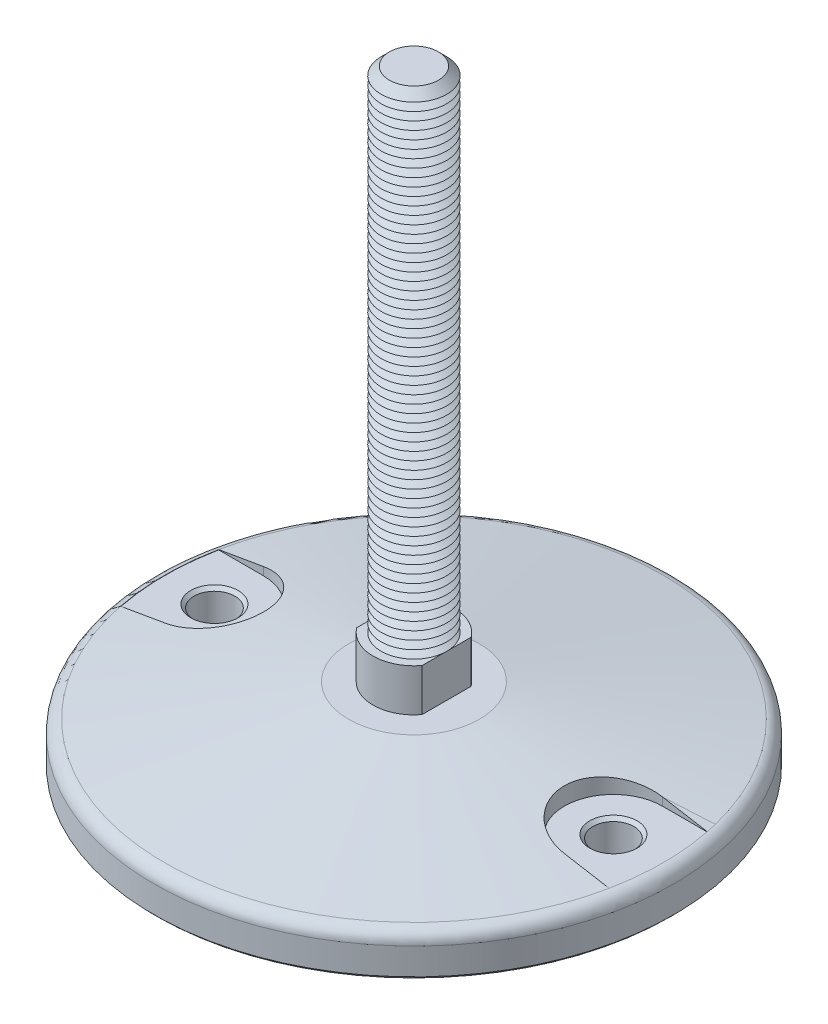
from build123d import *

# Parameters (mm, degrees)
FILLET1_R                = 4
SKETCH3_R                = 12.5
BOSS_EXTRUDE1_DEPTH      = 13
CUT_EXTRUDE1_START       = -13
CUT_EXTRUDE1_DEPTH       = 13
SKETCH5_R                = 10
BOSS_EXTRUDE2_DEPTH      = 150
CHAMFER1_SIZE            = 2.5
LPATTERN1_COUNT          = 59
LPATTERN1_PITCH          = 2.5
CUT_EXTRUDE4_DEPTH       = 10
SKETCH10_R               = 6.25
CUT_EXTRUDE5_DEPTH       = 13
CHAMFER2_SIZE            = 1
CHAMFER2_OF_MIRROR1_SIZE = 1
CHAMFER3_SIZE            = 1


with BuildPart() as part:
    # Sketch2 → Revolve1 (revolve)
    with BuildSketch(Plane(origin=(0, 0, 0), x_dir=(0, 0, -1), z_dir=(1, 0, 0)), mode=Mode.PRIVATE) as revolve1_sk:
        Polygon((0, 0), (-20, 0), (-79.5, -10.491455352), (-79.5, -23), (0, -23), align=None)
    revolve(revolve1_sk.sketch.rotate(Axis((0, 61.338865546, 0), (0, -1, 0)), 180), axis=Axis((0, 61.338865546, 0), (0, -1, 0)))

    # Fillet1
    fillet1_edges = [part.edges().sort_by_distance(p)[0] for p in [
        (0, -10.491455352, 79.5),
    ]]
    fillet(fillet1_edges, radius=FILLET1_R)

    # Sketch3 → Boss-Extrude1 (add)
    with BuildSketch(Plane(origin=(0, 0, 0), x_dir=(1, 0, 0), z_dir=(0, 1, 0))):
        with Locations(Location((0, 0, 0), (0, 0, 90))):
            Circle(SKETCH3_R)
    extrude(amount=BOSS_EXTRUDE1_DEPTH)

    # Sketch4 → Cut-Extrude1 (cut)
    with BuildSketch(Plane(origin=(0, 13, 0), x_dir=(1, 0, 0), z_dir=(0, 1, 0)).offset(CUT_EXTRUDE1_START)):
        with BuildLine():
            Line((-10, 7.5), (-10, -7.5))
            ThreePointArc((-10, -7.5), (-12.5, 0), (-10, 7.5))
        make_face()
        with BuildLine():
            Line((10, -7.5), (10, 7.5))
            ThreePointArc((10, 7.5), (12.5, 0), (10, -7.5))
        make_face()
    extrude(amount=CUT_EXTRUDE1_DEPTH, mode=Mode.SUBTRACT)

    # Sketch5 → Boss-Extrude2 (add)
    with BuildSketch(Plane(origin=(0, 13, 0), x_dir=(1, 0, 0), z_dir=(0, 1, 0))):
        with Locations(Location((0, 0, 0), (0, 0, 180))):
            Circle(SKETCH5_R)
    extrude(amount=BOSS_EXTRUDE2_DEPTH)

    # Chamfer1
    chamfer1_edges = [part.edges().sort_by_distance(p)[0] for p in [
        (10, 163, 0),
    ]]
    chamfer(chamfer1_edges, length=CHAMFER1_SIZE)

    # Sketch6 → Cut-Revolve1 (revolve, cut)
    with BuildSketch(Plane(origin=(0, 0, 0), x_dir=(0, 0, -1), z_dir=(1, 0, 0))):
        Polygon((-10, 13), (-7.834936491, 14.25), (-10, 15.5), align=None)
    cut_revolve1 = revolve(axis=Axis((0, 61.338865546, 0), (0, -1, 0)), mode=Mode.SUBTRACT)

    # LPattern1: Cut-Revolve1 ×59
    with Locations(*[(0, i * LPATTERN1_PITCH, 0) for i in range(1, LPATTERN1_COUNT)]):
        add(cut_revolve1, mode=Mode.SUBTRACT)

    # Sketch8 → Cut-Extrude4 (cut)
    with BuildSketch(Plane(origin=(0, 0, 0), x_dir=(1, 0, 0), z_dir=(0, 1, 0))):
        with BuildLine():
            Line((-61, 15), (-74.703520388, 15))
            ThreePointArc((-74.703520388, 15), (-76.194592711, 0), (-74.703520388, -15))
            Line((-74.703520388, -15), (-61, -15))
            ThreePointArc((-61, -15), (-46, 0), (-61, 15))
        make_face()
    cut_extrude4 = extrude(amount=-CUT_EXTRUDE4_DEPTH, mode=Mode.SUBTRACT)

    # Sketch10 → Cut-Extrude5 (cut)
    with BuildSketch(Plane(origin=(0, -10, 0), x_dir=(1, 0, 0), z_dir=(0, 1, 0))):
        with Locations(Location((-61, 0, 0), (0, 0, 270))):
            Circle(SKETCH10_R)
    cut_extrude5 = extrude(amount=-CUT_EXTRUDE5_DEPTH, mode=Mode.SUBTRACT)

    # Chamfer2
    chamfer2_edges = [part.edges().sort_by_distance(p)[0] for p in [
        (-61, -10, -6.25),
        (-61, -23, -6.25),
    ]]
    chamfer(chamfer2_edges, length=CHAMFER2_SIZE)

    # Mirror1: Cut-Extrude4, Cut-Extrude5 across plane
    add(cut_extrude4.mirror(Plane(origin=(0, 0, 0), x_dir=(0, 0, 1), z_dir=(1, 0, 0))), mode=Mode.SUBTRACT)
    add(cut_extrude5.mirror(Plane(origin=(0, 0, 0), x_dir=(0, 0, 1), z_dir=(1, 0, 0))), mode=Mode.SUBTRACT)

    # Chamfer2 of Mirror1
    chamfer2_of_mirror1_edges = [part.edges().sort_by_distance(p)[0] for p in [
        (61, -10, -6.25),
        (61, -23, -6.25),
    ]]
    chamfer(chamfer2_of_mirror1_edges, length=CHAMFER2_OF_MIRROR1_SIZE)

    # Chamfer3
    chamfer3_edges = [part.edges().sort_by_distance(p)[0] for p in [
        (0, -23, 79.5),
    ]]
    chamfer(chamfer3_edges, length=CHAMFER3_SIZE)


solid = part.part
